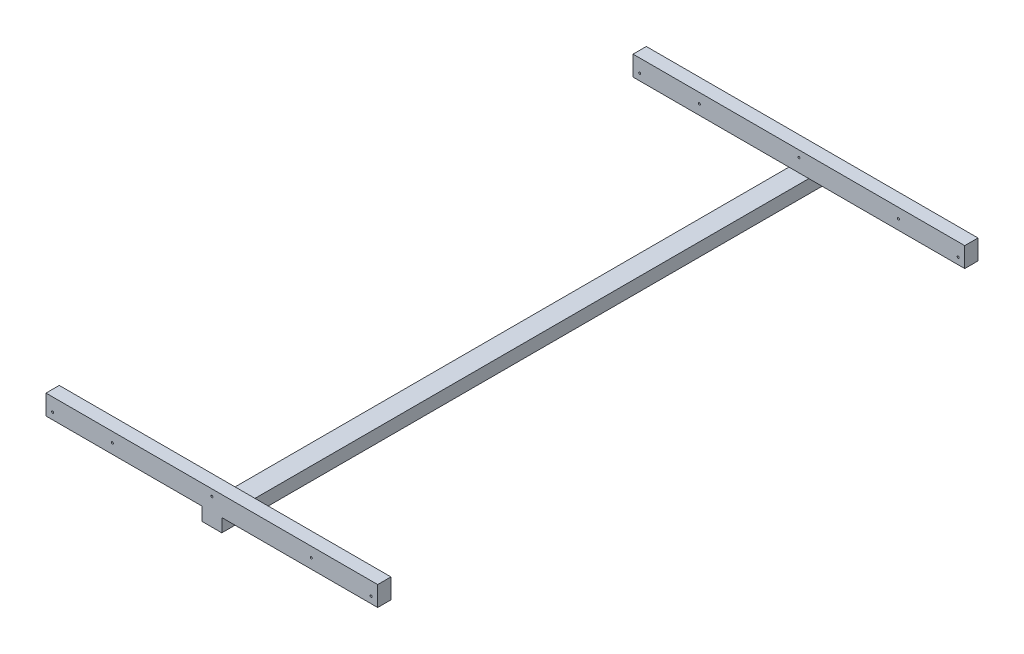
ISO-10303-21;
HEADER;
FILE_DESCRIPTION(('STEP AP214'),'2;1');
FILE_NAME('part.step','',(''),(''),'','','');
FILE_SCHEMA(('AUTOMOTIVE_DESIGN { 1 0 10303 214 1 1 1 1 }'));
ENDSEC;
DATA;
#1=APPLICATION_CONTEXT('core data for automotive mechanical design processes');
#2=APPLICATION_PROTOCOL_DEFINITION('international standard','automotive_design',2000,#1);
#3=PRODUCT_CONTEXT('',#1,'mechanical');
#4=PRODUCT('Part','Part','',(#3));
#5=PRODUCT_RELATED_PRODUCT_CATEGORY('part','',(#4));
#6=PRODUCT_DEFINITION_FORMATION('','',#4);
#7=PRODUCT_DEFINITION_CONTEXT('part definition',#1,'design');
#8=PRODUCT_DEFINITION('design','',#6,#7);
#9=PRODUCT_DEFINITION_SHAPE('','',#8);
#10=(LENGTH_UNIT() NAMED_UNIT(*) SI_UNIT(.MILLI.,.METRE.));
#11=(NAMED_UNIT(*) PLANE_ANGLE_UNIT() SI_UNIT($,.RADIAN.));
#12=(NAMED_UNIT(*) SI_UNIT($,.STERADIAN.) SOLID_ANGLE_UNIT());
#13=UNCERTAINTY_MEASURE_WITH_UNIT(LENGTH_MEASURE(1.E-05),#10,'distance_accuracy_value','');
#14=(GEOMETRIC_REPRESENTATION_CONTEXT(3) GLOBAL_UNCERTAINTY_ASSIGNED_CONTEXT((#13)) GLOBAL_UNIT_ASSIGNED_CONTEXT((#10,
#11,#12)) REPRESENTATION_CONTEXT('',''));
#15=CARTESIAN_POINT('',(0.,0.,0.));
#16=DIRECTION('',(0.,0.,1.));
#17=DIRECTION('',(1.,0.,0.));
#18=AXIS2_PLACEMENT_3D('',#15,#16,#17);
#19=CARTESIAN_POINT('',(30.,20.,905.));
#20=DIRECTION('',(0.,-1.,0.));
#21=DIRECTION('',(1.,0.,0.));
#22=AXIS2_PLACEMENT_3D('',#19,#20,#21);
#23=PLANE('',#22);
#24=DIRECTION('',(-1.,0.,0.));
#25=VECTOR('',#24,1.);
#26=CARTESIAN_POINT('',(500.,20.,-865.));
#27=LINE('',#26,#25);
#28=CARTESIAN_POINT('',(30.,20.,-865.));
#29=VERTEX_POINT('',#28);
#30=CARTESIAN_POINT('',(-30.,20.,-865.));
#31=VERTEX_POINT('',#30);
#32=EDGE_CURVE('E56',#29,#31,#27,.T.);
#33=ORIENTED_EDGE('',*,*,#32,.T.);
#34=DIRECTION('',(0.,0.,-1.));
#35=VECTOR('',#34,1.);
#36=CARTESIAN_POINT('',(-30.,20.,905.));
#37=LINE('',#36,#35);
#38=CARTESIAN_POINT('',(-30.,20.,865.));
#39=VERTEX_POINT('',#38);
#40=EDGE_CURVE('E323',#39,#31,#37,.T.);
#41=ORIENTED_EDGE('',*,*,#40,.F.);
#42=DIRECTION('',(-1.,0.,0.));
#43=VECTOR('',#42,1.);
#44=CARTESIAN_POINT('',(500.,20.,865.));
#45=LINE('',#44,#43);
#46=CARTESIAN_POINT('',(30.,20.,865.));
#47=VERTEX_POINT('',#46);
#48=EDGE_CURVE('E11',#47,#39,#45,.T.);
#49=ORIENTED_EDGE('',*,*,#48,.F.);
#50=DIRECTION('',(0.,0.,-1.));
#51=VECTOR('',#50,1.);
#52=CARTESIAN_POINT('',(30.,20.,905.));
#53=LINE('',#52,#51);
#54=EDGE_CURVE('E322',#47,#29,#53,.T.);
#55=ORIENTED_EDGE('',*,*,#54,.T.);
#56=EDGE_LOOP('',(#33,#41,#49,#55));
#57=FACE_BOUND('',#56,.T.);
#58=ADVANCED_FACE('F37',(#57),#23,.F.);
#59=CARTESIAN_POINT('',(-30.,-20.,905.));
#60=DIRECTION('',(1.,0.,0.));
#61=DIRECTION('',(0.,0.,-1.));
#62=AXIS2_PLACEMENT_3D('',#59,#60,#61);
#63=PLANE('',#62);
#64=DIRECTION('',(0.,-1.,0.));
#65=VECTOR('',#64,1.);
#66=CARTESIAN_POINT('',(-30.,-20.,-905.));
#67=LINE('',#66,#65);
#68=CARTESIAN_POINT('',(-30.,20.,-905.));
#69=VERTEX_POINT('',#68);
#70=CARTESIAN_POINT('',(-30.,-20.,-905.));
#71=VERTEX_POINT('',#70);
#72=EDGE_CURVE('E307',#69,#71,#67,.T.);
#73=ORIENTED_EDGE('',*,*,#72,.T.);
#74=DIRECTION('',(0.,0.,-1.));
#75=VECTOR('',#74,1.);
#76=CARTESIAN_POINT('',(-30.,-20.,905.));
#77=LINE('',#76,#75);
#78=CARTESIAN_POINT('',(-30.,-20.,905.));
#79=VERTEX_POINT('',#78);
#80=EDGE_CURVE('E46',#79,#71,#77,.T.);
#81=ORIENTED_EDGE('',*,*,#80,.F.);
#82=DIRECTION('',(0.,-1.,0.));
#83=VECTOR('',#82,1.);
#84=CARTESIAN_POINT('',(-30.,-20.,905.));
#85=LINE('',#84,#83);
#86=CARTESIAN_POINT('',(-30.,20.,905.));
#87=VERTEX_POINT('',#86);
#88=EDGE_CURVE('E313',#87,#79,#85,.T.);
#89=ORIENTED_EDGE('',*,*,#88,.F.);
#90=EDGE_CURVE('E320',#87,#39,#37,.T.);
#91=ORIENTED_EDGE('',*,*,#90,.T.);
#92=ORIENTED_EDGE('',*,*,#40,.T.);
#93=DIRECTION('',(0.,0.,1.));
#94=VECTOR('',#93,1.);
#95=CARTESIAN_POINT('',(-30.,20.0000000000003,905.));
#96=LINE('',#95,#94);
#97=EDGE_CURVE('E170',#69,#31,#96,.T.);
#98=ORIENTED_EDGE('',*,*,#97,.F.);
#99=EDGE_LOOP('',(#73,#81,#89,#91,#92,#98));
#100=FACE_BOUND('',#99,.T.);
#101=ADVANCED_FACE('F39',(#100),#63,.F.);
#102=CARTESIAN_POINT('',(30.,-20.,905.));
#103=DIRECTION('',(0.,1.,0.));
#104=DIRECTION('',(-1.,0.,0.));
#105=AXIS2_PLACEMENT_3D('',#102,#103,#104);
#106=PLANE('',#105);
#107=DIRECTION('',(1.,0.,0.));
#108=VECTOR('',#107,1.);
#109=CARTESIAN_POINT('',(30.,-20.,-905.));
#110=LINE('',#109,#108);
#111=CARTESIAN_POINT('',(30.,-20.,-905.));
#112=VERTEX_POINT('',#111);
#113=EDGE_CURVE('E300',#71,#112,#110,.T.);
#114=ORIENTED_EDGE('',*,*,#113,.T.);
#115=DIRECTION('',(0.,0.,-1.));
#116=VECTOR('',#115,1.);
#117=CARTESIAN_POINT('',(30.,-20.,905.));
#118=LINE('',#117,#116);
#119=CARTESIAN_POINT('',(30.,-20.,905.));
#120=VERTEX_POINT('',#119);
#121=EDGE_CURVE('E302',#120,#112,#118,.T.);
#122=ORIENTED_EDGE('',*,*,#121,.F.);
#123=DIRECTION('',(1.,0.,0.));
#124=VECTOR('',#123,1.);
#125=CARTESIAN_POINT('',(30.,-20.,905.));
#126=LINE('',#125,#124);
#127=EDGE_CURVE('E316',#79,#120,#126,.T.);
#128=ORIENTED_EDGE('',*,*,#127,.F.);
#129=ORIENTED_EDGE('',*,*,#80,.T.);
#130=EDGE_LOOP('',(#114,#122,#128,#129));
#131=FACE_BOUND('',#130,.T.);
#132=ADVANCED_FACE('F285',(#131),#106,.F.);
#133=CARTESIAN_POINT('',(30.,-20.,905.));
#134=DIRECTION('',(-1.,0.,0.));
#135=DIRECTION('',(0.,0.,1.));
#136=AXIS2_PLACEMENT_3D('',#133,#134,#135);
#137=PLANE('',#136);
#138=DIRECTION('',(0.,1.,0.));
#139=VECTOR('',#138,1.);
#140=CARTESIAN_POINT('',(30.,-20.,-905.));
#141=LINE('',#140,#139);
#142=CARTESIAN_POINT('',(30.,20.,-905.));
#143=VERTEX_POINT('',#142);
#144=EDGE_CURVE('E306',#112,#143,#141,.T.);
#145=ORIENTED_EDGE('',*,*,#144,.T.);
#146=DIRECTION('',(0.,0.,-1.));
#147=VECTOR('',#146,1.);
#148=CARTESIAN_POINT('',(30.,20.0000000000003,905.));
#149=LINE('',#148,#147);
#150=EDGE_CURVE('E64',#29,#143,#149,.T.);
#151=ORIENTED_EDGE('',*,*,#150,.F.);
#152=ORIENTED_EDGE('',*,*,#54,.F.);
#153=CARTESIAN_POINT('',(30.,20.,905.));
#154=VERTEX_POINT('',#153);
#155=EDGE_CURVE('E311',#154,#47,#53,.T.);
#156=ORIENTED_EDGE('',*,*,#155,.F.);
#157=DIRECTION('',(0.,1.,0.));
#158=VECTOR('',#157,1.);
#159=CARTESIAN_POINT('',(30.,-20.,905.));
#160=LINE('',#159,#158);
#161=EDGE_CURVE('E310',#120,#154,#160,.T.);
#162=ORIENTED_EDGE('',*,*,#161,.F.);
#163=ORIENTED_EDGE('',*,*,#121,.T.);
#164=EDGE_LOOP('',(#145,#151,#152,#156,#162,#163));
#165=FACE_BOUND('',#164,.T.);
#166=ADVANCED_FACE('F291',(#165),#137,.F.);
#167=CARTESIAN_POINT('',(0.,0.,905.));
#168=DIRECTION('',(0.,0.,1.));
#169=DIRECTION('',(1.,0.,0.));
#170=AXIS2_PLACEMENT_3D('',#167,#168,#169);
#171=PLANE('',#170);
#172=CARTESIAN_POINT('',(480.,40.,905.));
#173=DIRECTION('',(0.,0.,1.));
#174=DIRECTION('',(1.,0.,0.));
#175=AXIS2_PLACEMENT_3D('',#172,#173,#174);
#176=CIRCLE('',#175,2.99999999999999);
#177=CARTESIAN_POINT('',(483.,40.,905.));
#178=VERTEX_POINT('',#177);
#179=EDGE_CURVE('E205',#178,#178,#176,.T.);
#180=ORIENTED_EDGE('',*,*,#179,.F.);
#181=EDGE_LOOP('',(#180));
#182=FACE_BOUND('',#181,.T.);
#183=CARTESIAN_POINT('',(-480.,40.,905.));
#184=DIRECTION('',(0.,0.,1.));
#185=DIRECTION('',(1.,0.,0.));
#186=AXIS2_PLACEMENT_3D('',#183,#184,#185);
#187=CIRCLE('',#186,2.99999999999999);
#188=CARTESIAN_POINT('',(-477.,40.,905.));
#189=VERTEX_POINT('',#188);
#190=EDGE_CURVE('E211',#189,#189,#187,.T.);
#191=ORIENTED_EDGE('',*,*,#190,.F.);
#192=EDGE_LOOP('',(#191));
#193=FACE_BOUND('',#192,.T.);
#194=CARTESIAN_POINT('',(-300.,50.,905.));
#195=DIRECTION('',(0.,0.,1.));
#196=DIRECTION('',(1.,0.,0.));
#197=AXIS2_PLACEMENT_3D('',#194,#195,#196);
#198=CIRCLE('',#197,2.99999999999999);
#199=CARTESIAN_POINT('',(-297.,50.,905.));
#200=VERTEX_POINT('',#199);
#201=EDGE_CURVE('E218',#200,#200,#198,.T.);
#202=ORIENTED_EDGE('',*,*,#201,.F.);
#203=EDGE_LOOP('',(#202));
#204=FACE_BOUND('',#203,.T.);
#205=CARTESIAN_POINT('',(300.,50.,905.));
#206=DIRECTION('',(0.,0.,1.));
#207=DIRECTION('',(1.,0.,0.));
#208=AXIS2_PLACEMENT_3D('',#205,#206,#207);
#209=CIRCLE('',#208,2.99999999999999);
#210=CARTESIAN_POINT('',(303.,50.,905.));
#211=VERTEX_POINT('',#210);
#212=EDGE_CURVE('E225',#211,#211,#209,.T.);
#213=ORIENTED_EDGE('',*,*,#212,.F.);
#214=EDGE_LOOP('',(#213));
#215=FACE_BOUND('',#214,.T.);
#216=CARTESIAN_POINT('',(0.,60.,905.));
#217=DIRECTION('',(0.,0.,1.));
#218=DIRECTION('',(1.,0.,0.));
#219=AXIS2_PLACEMENT_3D('',#216,#217,#218);
#220=CIRCLE('',#219,3.);
#221=CARTESIAN_POINT('',(3.,60.,905.));
#222=VERTEX_POINT('',#221);
#223=EDGE_CURVE('E193',#222,#222,#220,.T.);
#224=ORIENTED_EDGE('',*,*,#223,.F.);
#225=EDGE_LOOP('',(#224));
#226=FACE_BOUND('',#225,.T.);
#227=ORIENTED_EDGE('',*,*,#88,.T.);
#228=ORIENTED_EDGE('',*,*,#127,.T.);
#229=ORIENTED_EDGE('',*,*,#161,.T.);
#230=DIRECTION('',(-1.,0.,0.));
#231=VECTOR('',#230,1.);
#232=CARTESIAN_POINT('',(500.,20.,905.));
#233=LINE('',#232,#231);
#234=CARTESIAN_POINT('',(500.,20.,905.));
#235=VERTEX_POINT('',#234);
#236=EDGE_CURVE('E330',#235,#154,#233,.T.);
#237=ORIENTED_EDGE('',*,*,#236,.F.);
#238=DIRECTION('',(0.,-1.,0.));
#239=VECTOR('',#238,1.);
#240=CARTESIAN_POINT('',(500.,80.,905.));
#241=LINE('',#240,#239);
#242=CARTESIAN_POINT('',(500.,80.,905.));
#243=VERTEX_POINT('',#242);
#244=EDGE_CURVE('E419',#243,#235,#241,.T.);
#245=ORIENTED_EDGE('',*,*,#244,.F.);
#246=DIRECTION('',(-1.,0.,0.));
#247=VECTOR('',#246,1.);
#248=CARTESIAN_POINT('',(500.,80.,905.));
#249=LINE('',#248,#247);
#250=CARTESIAN_POINT('',(-500.,80.,905.));
#251=VERTEX_POINT('',#250);
#252=EDGE_CURVE('E417',#243,#251,#249,.T.);
#253=ORIENTED_EDGE('',*,*,#252,.T.);
#254=DIRECTION('',(0.,-1.,0.));
#255=VECTOR('',#254,1.);
#256=CARTESIAN_POINT('',(-500.,80.,905.));
#257=LINE('',#256,#255);
#258=CARTESIAN_POINT('',(-500.,20.,905.));
#259=VERTEX_POINT('',#258);
#260=EDGE_CURVE('E346',#251,#259,#257,.T.);
#261=ORIENTED_EDGE('',*,*,#260,.T.);
#262=EDGE_CURVE('E336',#87,#259,#233,.T.);
#263=ORIENTED_EDGE('',*,*,#262,.F.);
#264=EDGE_LOOP('',(#227,#228,#229,#237,#245,#253,#261,#263));
#265=FACE_BOUND('',#264,.T.);
#266=ADVANCED_FACE('F293',(#182,#193,#204,#215,#226,#265),#171,.T.);
#267=CARTESIAN_POINT('',(0.,0.,-905.));
#268=DIRECTION('',(0.,0.,1.));
#269=DIRECTION('',(1.,0.,0.));
#270=AXIS2_PLACEMENT_3D('',#267,#268,#269);
#271=PLANE('',#270);
#272=CARTESIAN_POINT('',(480.,40.,-905.));
#273=DIRECTION('',(0.,0.,1.));
#274=DIRECTION('',(1.,0.,0.));
#275=AXIS2_PLACEMENT_3D('',#272,#273,#274);
#276=CIRCLE('',#275,2.99999999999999);
#277=CARTESIAN_POINT('',(483.,40.,-905.));
#278=VERTEX_POINT('',#277);
#279=EDGE_CURVE('E241',#278,#278,#276,.T.);
#280=ORIENTED_EDGE('',*,*,#279,.T.);
#281=EDGE_LOOP('',(#280));
#282=FACE_BOUND('',#281,.T.);
#283=CARTESIAN_POINT('',(-480.,40.,-905.));
#284=DIRECTION('',(0.,0.,1.));
#285=DIRECTION('',(-1.,0.,0.));
#286=AXIS2_PLACEMENT_3D('',#283,#284,#285);
#287=CIRCLE('',#286,2.99999999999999);
#288=CARTESIAN_POINT('',(-483.,40.,-905.));
#289=VERTEX_POINT('',#288);
#290=EDGE_CURVE('E238',#289,#289,#287,.T.);
#291=ORIENTED_EDGE('',*,*,#290,.T.);
#292=EDGE_LOOP('',(#291));
#293=FACE_BOUND('',#292,.T.);
#294=CARTESIAN_POINT('',(-300.,50.,-905.));
#295=DIRECTION('',(0.,0.,1.));
#296=DIRECTION('',(1.,0.,0.));
#297=AXIS2_PLACEMENT_3D('',#294,#295,#296);
#298=CIRCLE('',#297,2.99999999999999);
#299=CARTESIAN_POINT('',(-297.,50.,-905.));
#300=VERTEX_POINT('',#299);
#301=EDGE_CURVE('E235',#300,#300,#298,.T.);
#302=ORIENTED_EDGE('',*,*,#301,.T.);
#303=EDGE_LOOP('',(#302));
#304=FACE_BOUND('',#303,.T.);
#305=CARTESIAN_POINT('',(300.,50.,-905.));
#306=DIRECTION('',(0.,0.,1.));
#307=DIRECTION('',(-1.,0.,0.));
#308=AXIS2_PLACEMENT_3D('',#305,#306,#307);
#309=CIRCLE('',#308,2.99999999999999);
#310=CARTESIAN_POINT('',(297.,50.,-905.));
#311=VERTEX_POINT('',#310);
#312=EDGE_CURVE('E232',#311,#311,#309,.T.);
#313=ORIENTED_EDGE('',*,*,#312,.T.);
#314=EDGE_LOOP('',(#313));
#315=FACE_BOUND('',#314,.T.);
#316=CARTESIAN_POINT('',(0.,60.,-905.));
#317=DIRECTION('',(0.,0.,1.));
#318=DIRECTION('',(1.,0.,0.));
#319=AXIS2_PLACEMENT_3D('',#316,#317,#318);
#320=CIRCLE('',#319,3.);
#321=CARTESIAN_POINT('',(3.,60.,-905.));
#322=VERTEX_POINT('',#321);
#323=EDGE_CURVE('E202',#322,#322,#320,.T.);
#324=ORIENTED_EDGE('',*,*,#323,.T.);
#325=EDGE_LOOP('',(#324));
#326=FACE_BOUND('',#325,.T.);
#327=ORIENTED_EDGE('',*,*,#72,.F.);
#328=DIRECTION('',(-1.,0.,0.));
#329=VECTOR('',#328,1.);
#330=CARTESIAN_POINT('',(500.,20.,-905.));
#331=LINE('',#330,#329);
#332=CARTESIAN_POINT('',(-500.,20.,-905.));
#333=VERTEX_POINT('',#332);
#334=EDGE_CURVE('E177',#69,#333,#331,.T.);
#335=ORIENTED_EDGE('',*,*,#334,.T.);
#336=DIRECTION('',(0.,1.,0.));
#337=VECTOR('',#336,1.);
#338=CARTESIAN_POINT('',(-500.,80.,-905.));
#339=LINE('',#338,#337);
#340=CARTESIAN_POINT('',(-500.,80.,-905.));
#341=VERTEX_POINT('',#340);
#342=EDGE_CURVE('E187',#333,#341,#339,.T.);
#343=ORIENTED_EDGE('',*,*,#342,.T.);
#344=DIRECTION('',(-1.,0.,0.));
#345=VECTOR('',#344,1.);
#346=CARTESIAN_POINT('',(500.,80.,-905.));
#347=LINE('',#346,#345);
#348=CARTESIAN_POINT('',(500.,80.,-905.));
#349=VERTEX_POINT('',#348);
#350=EDGE_CURVE('E180',#349,#341,#347,.T.);
#351=ORIENTED_EDGE('',*,*,#350,.F.);
#352=DIRECTION('',(0.,1.,0.));
#353=VECTOR('',#352,1.);
#354=CARTESIAN_POINT('',(500.,80.,-905.));
#355=LINE('',#354,#353);
#356=CARTESIAN_POINT('',(500.,20.,-905.));
#357=VERTEX_POINT('',#356);
#358=EDGE_CURVE('E153',#357,#349,#355,.T.);
#359=ORIENTED_EDGE('',*,*,#358,.F.);
#360=EDGE_CURVE('E150',#357,#143,#331,.T.);
#361=ORIENTED_EDGE('',*,*,#360,.T.);
#362=ORIENTED_EDGE('',*,*,#144,.F.);
#363=ORIENTED_EDGE('',*,*,#113,.F.);
#364=EDGE_LOOP('',(#327,#335,#343,#351,#359,#361,#362,#363));
#365=FACE_BOUND('',#364,.T.);
#366=ADVANCED_FACE('F289',(#282,#293,#304,#315,#326,#365),#271,.F.);
#367=CARTESIAN_POINT('',(500.,20.,865.));
#368=DIRECTION('',(0.,1.,0.));
#369=DIRECTION('',(0.,0.,1.));
#370=AXIS2_PLACEMENT_3D('',#367,#368,#369);
#371=PLANE('',#370);
#372=ORIENTED_EDGE('',*,*,#236,.T.);
#373=ORIENTED_EDGE('',*,*,#155,.T.);
#374=CARTESIAN_POINT('',(500.,20.,865.));
#375=VERTEX_POINT('',#374);
#376=EDGE_CURVE('E48',#375,#47,#45,.T.);
#377=ORIENTED_EDGE('',*,*,#376,.F.);
#378=DIRECTION('',(0.,0.,-1.));
#379=VECTOR('',#378,1.);
#380=CARTESIAN_POINT('',(500.,20.,865.));
#381=LINE('',#380,#379);
#382=EDGE_CURVE('E332',#235,#375,#381,.T.);
#383=ORIENTED_EDGE('',*,*,#382,.F.);
#384=EDGE_LOOP('',(#372,#373,#377,#383));
#385=FACE_BOUND('',#384,.T.);
#386=ADVANCED_FACE('F331',(#385),#371,.F.);
#387=ORIENTED_EDGE('',*,*,#90,.F.);
#388=ORIENTED_EDGE('',*,*,#262,.T.);
#389=DIRECTION('',(0.,0.,-1.));
#390=VECTOR('',#389,1.);
#391=CARTESIAN_POINT('',(-500.,20.,865.));
#392=LINE('',#391,#390);
#393=CARTESIAN_POINT('',(-500.,20.,865.));
#394=VERTEX_POINT('',#393);
#395=EDGE_CURVE('E406',#259,#394,#392,.T.);
#396=ORIENTED_EDGE('',*,*,#395,.T.);
#397=EDGE_CURVE('E49',#39,#394,#45,.T.);
#398=ORIENTED_EDGE('',*,*,#397,.F.);
#399=EDGE_LOOP('',(#387,#388,#396,#398));
#400=FACE_BOUND('',#399,.T.);
#401=ADVANCED_FACE('F384',(#400),#371,.F.);
#402=CARTESIAN_POINT('',(500.,80.,865.));
#403=DIRECTION('',(0.,0.,1.));
#404=DIRECTION('',(1.,0.,0.));
#405=AXIS2_PLACEMENT_3D('',#402,#403,#404);
#406=PLANE('',#405);
#407=CARTESIAN_POINT('',(480.,40.,865.));
#408=DIRECTION('',(0.,0.,1.));
#409=DIRECTION('',(1.,0.,0.));
#410=AXIS2_PLACEMENT_3D('',#407,#408,#409);
#411=CIRCLE('',#410,2.99999999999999);
#412=CARTESIAN_POINT('',(483.,40.,865.));
#413=VERTEX_POINT('',#412);
#414=EDGE_CURVE('E208',#413,#413,#411,.T.);
#415=ORIENTED_EDGE('',*,*,#414,.T.);
#416=EDGE_LOOP('',(#415));
#417=FACE_BOUND('',#416,.T.);
#418=CARTESIAN_POINT('',(-480.,40.,865.));
#419=DIRECTION('',(0.,0.,1.));
#420=DIRECTION('',(1.,0.,0.));
#421=AXIS2_PLACEMENT_3D('',#418,#419,#420);
#422=CIRCLE('',#421,2.99999999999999);
#423=CARTESIAN_POINT('',(-477.,40.,865.));
#424=VERTEX_POINT('',#423);
#425=EDGE_CURVE('E214',#424,#424,#422,.T.);
#426=ORIENTED_EDGE('',*,*,#425,.T.);
#427=EDGE_LOOP('',(#426));
#428=FACE_BOUND('',#427,.T.);
#429=CARTESIAN_POINT('',(-300.,50.,865.));
#430=DIRECTION('',(0.,0.,1.));
#431=DIRECTION('',(1.,0.,0.));
#432=AXIS2_PLACEMENT_3D('',#429,#430,#431);
#433=CIRCLE('',#432,2.99999999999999);
#434=CARTESIAN_POINT('',(-297.,50.,865.));
#435=VERTEX_POINT('',#434);
#436=EDGE_CURVE('E221',#435,#435,#433,.T.);
#437=ORIENTED_EDGE('',*,*,#436,.T.);
#438=EDGE_LOOP('',(#437));
#439=FACE_BOUND('',#438,.T.);
#440=CARTESIAN_POINT('',(300.,50.,865.));
#441=DIRECTION('',(0.,0.,1.));
#442=DIRECTION('',(1.,0.,0.));
#443=AXIS2_PLACEMENT_3D('',#440,#441,#442);
#444=CIRCLE('',#443,2.99999999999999);
#445=CARTESIAN_POINT('',(303.,50.,865.));
#446=VERTEX_POINT('',#445);
#447=EDGE_CURVE('E228',#446,#446,#444,.T.);
#448=ORIENTED_EDGE('',*,*,#447,.T.);
#449=EDGE_LOOP('',(#448));
#450=FACE_BOUND('',#449,.T.);
#451=CARTESIAN_POINT('',(0.,60.,865.));
#452=DIRECTION('',(0.,0.,1.));
#453=DIRECTION('',(1.,0.,0.));
#454=AXIS2_PLACEMENT_3D('',#451,#452,#453);
#455=CIRCLE('',#454,3.);
#456=CARTESIAN_POINT('',(3.,60.,865.));
#457=VERTEX_POINT('',#456);
#458=EDGE_CURVE('E198',#457,#457,#455,.T.);
#459=ORIENTED_EDGE('',*,*,#458,.T.);
#460=EDGE_LOOP('',(#459));
#461=FACE_BOUND('',#460,.T.);
#462=DIRECTION('',(0.,1.,0.));
#463=VECTOR('',#462,1.);
#464=CARTESIAN_POINT('',(-500.,80.,865.));
#465=LINE('',#464,#463);
#466=CARTESIAN_POINT('',(-500.,80.,865.));
#467=VERTEX_POINT('',#466);
#468=EDGE_CURVE('E425',#394,#467,#465,.T.);
#469=ORIENTED_EDGE('',*,*,#468,.T.);
#470=DIRECTION('',(-1.,0.,0.));
#471=VECTOR('',#470,1.);
#472=CARTESIAN_POINT('',(500.,80.,865.));
#473=LINE('',#472,#471);
#474=CARTESIAN_POINT('',(500.,80.,865.));
#475=VERTEX_POINT('',#474);
#476=EDGE_CURVE('E409',#475,#467,#473,.T.);
#477=ORIENTED_EDGE('',*,*,#476,.F.);
#478=DIRECTION('',(0.,1.,0.));
#479=VECTOR('',#478,1.);
#480=CARTESIAN_POINT('',(500.,80.,865.));
#481=LINE('',#480,#479);
#482=EDGE_CURVE('E412',#375,#475,#481,.T.);
#483=ORIENTED_EDGE('',*,*,#482,.F.);
#484=ORIENTED_EDGE('',*,*,#376,.T.);
#485=ORIENTED_EDGE('',*,*,#48,.T.);
#486=ORIENTED_EDGE('',*,*,#397,.T.);
#487=EDGE_LOOP('',(#469,#477,#483,#484,#485,#486));
#488=FACE_BOUND('',#487,.T.);
#489=ADVANCED_FACE('F380',(#417,#428,#439,#450,#461,#488),#406,.F.);
#490=CARTESIAN_POINT('',(500.,80.,865.));
#491=DIRECTION('',(0.,-1.,0.));
#492=DIRECTION('',(0.,0.,-1.));
#493=AXIS2_PLACEMENT_3D('',#490,#491,#492);
#494=PLANE('',#493);
#495=DIRECTION('',(0.,0.,1.));
#496=VECTOR('',#495,1.);
#497=CARTESIAN_POINT('',(-500.,80.,865.));
#498=LINE('',#497,#496);
#499=EDGE_CURVE('E427',#467,#251,#498,.T.);
#500=ORIENTED_EDGE('',*,*,#499,.T.);
#501=ORIENTED_EDGE('',*,*,#252,.F.);
#502=DIRECTION('',(0.,0.,1.));
#503=VECTOR('',#502,1.);
#504=CARTESIAN_POINT('',(500.,80.,865.));
#505=LINE('',#504,#503);
#506=EDGE_CURVE('E415',#475,#243,#505,.T.);
#507=ORIENTED_EDGE('',*,*,#506,.F.);
#508=ORIENTED_EDGE('',*,*,#476,.T.);
#509=EDGE_LOOP('',(#500,#501,#507,#508));
#510=FACE_BOUND('',#509,.T.);
#511=ADVANCED_FACE('F373',(#510),#494,.F.);
#512=CARTESIAN_POINT('',(500.,0.,0.));
#513=DIRECTION('',(-1.,0.,0.));
#514=DIRECTION('',(0.,0.,1.));
#515=AXIS2_PLACEMENT_3D('',#512,#513,#514);
#516=PLANE('',#515);
#517=ORIENTED_EDGE('',*,*,#244,.T.);
#518=ORIENTED_EDGE('',*,*,#382,.T.);
#519=ORIENTED_EDGE('',*,*,#482,.T.);
#520=ORIENTED_EDGE('',*,*,#506,.T.);
#521=EDGE_LOOP('',(#517,#518,#519,#520));
#522=FACE_BOUND('',#521,.T.);
#523=ADVANCED_FACE('F370',(#522),#516,.F.);
#524=CARTESIAN_POINT('',(-500.,0.,0.));
#525=DIRECTION('',(-1.,0.,0.));
#526=DIRECTION('',(0.,0.,1.));
#527=AXIS2_PLACEMENT_3D('',#524,#525,#526);
#528=PLANE('',#527);
#529=ORIENTED_EDGE('',*,*,#260,.F.);
#530=ORIENTED_EDGE('',*,*,#499,.F.);
#531=ORIENTED_EDGE('',*,*,#468,.F.);
#532=ORIENTED_EDGE('',*,*,#395,.F.);
#533=EDGE_LOOP('',(#529,#530,#531,#532));
#534=FACE_BOUND('',#533,.T.);
#535=ADVANCED_FACE('F368',(#534),#528,.T.);
#536=CARTESIAN_POINT('',(500.,20.,-865.));
#537=DIRECTION('',(0.,1.,0.));
#538=DIRECTION('',(0.,0.,1.));
#539=AXIS2_PLACEMENT_3D('',#536,#537,#538);
#540=PLANE('',#539);
#541=ORIENTED_EDGE('',*,*,#334,.F.);
#542=ORIENTED_EDGE('',*,*,#97,.T.);
#543=CARTESIAN_POINT('',(-500.,20.,-865.));
#544=VERTEX_POINT('',#543);
#545=EDGE_CURVE('E169',#31,#544,#27,.T.);
#546=ORIENTED_EDGE('',*,*,#545,.T.);
#547=DIRECTION('',(0.,0.,-1.));
#548=VECTOR('',#547,1.);
#549=CARTESIAN_POINT('',(-500.,20.,-865.));
#550=LINE('',#549,#548);
#551=EDGE_CURVE('E189',#544,#333,#550,.T.);
#552=ORIENTED_EDGE('',*,*,#551,.T.);
#553=EDGE_LOOP('',(#541,#542,#546,#552));
#554=FACE_BOUND('',#553,.T.);
#555=ADVANCED_FACE('F345',(#554),#540,.F.);
#556=CARTESIAN_POINT('',(500.,20.,-865.));
#557=VERTEX_POINT('',#556);
#558=EDGE_CURVE('E148',#557,#29,#27,.T.);
#559=ORIENTED_EDGE('',*,*,#558,.T.);
#560=ORIENTED_EDGE('',*,*,#150,.T.);
#561=ORIENTED_EDGE('',*,*,#360,.F.);
#562=DIRECTION('',(0.,0.,-1.));
#563=VECTOR('',#562,1.);
#564=CARTESIAN_POINT('',(500.,20.,-865.));
#565=LINE('',#564,#563);
#566=EDGE_CURVE('E144',#557,#357,#565,.T.);
#567=ORIENTED_EDGE('',*,*,#566,.F.);
#568=EDGE_LOOP('',(#559,#560,#561,#567));
#569=FACE_BOUND('',#568,.T.);
#570=ADVANCED_FACE('F146',(#569),#540,.F.);
#571=CARTESIAN_POINT('',(500.,80.,-865.));
#572=DIRECTION('',(0.,0.,-1.));
#573=DIRECTION('',(-1.,0.,0.));
#574=AXIS2_PLACEMENT_3D('',#571,#572,#573);
#575=PLANE('',#574);
#576=CARTESIAN_POINT('',(480.,40.,-865.));
#577=DIRECTION('',(0.,0.,-1.));
#578=DIRECTION('',(-1.,0.,0.));
#579=AXIS2_PLACEMENT_3D('',#576,#577,#578);
#580=CIRCLE('',#579,2.99999999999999);
#581=CARTESIAN_POINT('',(477.,40.,-865.));
#582=VERTEX_POINT('',#581);
#583=EDGE_CURVE('E41',#582,#582,#580,.T.);
#584=ORIENTED_EDGE('',*,*,#583,.T.);
#585=EDGE_LOOP('',(#584));
#586=FACE_BOUND('',#585,.T.);
#587=CARTESIAN_POINT('',(-480.,40.,-865.));
#588=DIRECTION('',(0.,0.,-1.));
#589=DIRECTION('',(-1.,0.,0.));
#590=AXIS2_PLACEMENT_3D('',#587,#588,#589);
#591=CIRCLE('',#590,2.99999999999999);
#592=CARTESIAN_POINT('',(-483.,40.,-865.));
#593=VERTEX_POINT('',#592);
#594=EDGE_CURVE('E217',#593,#593,#591,.T.);
#595=ORIENTED_EDGE('',*,*,#594,.T.);
#596=EDGE_LOOP('',(#595));
#597=FACE_BOUND('',#596,.T.);
#598=CARTESIAN_POINT('',(-300.,50.,-865.));
#599=DIRECTION('',(0.,0.,-1.));
#600=DIRECTION('',(-1.,0.,0.));
#601=AXIS2_PLACEMENT_3D('',#598,#599,#600);
#602=CIRCLE('',#601,2.99999999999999);
#603=CARTESIAN_POINT('',(-303.,50.,-865.));
#604=VERTEX_POINT('',#603);
#605=EDGE_CURVE('E224',#604,#604,#602,.T.);
#606=ORIENTED_EDGE('',*,*,#605,.T.);
#607=EDGE_LOOP('',(#606));
#608=FACE_BOUND('',#607,.T.);
#609=CARTESIAN_POINT('',(300.,50.,-865.));
#610=DIRECTION('',(0.,0.,-1.));
#611=DIRECTION('',(-1.,0.,0.));
#612=AXIS2_PLACEMENT_3D('',#609,#610,#611);
#613=CIRCLE('',#612,2.99999999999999);
#614=CARTESIAN_POINT('',(297.,50.,-865.));
#615=VERTEX_POINT('',#614);
#616=EDGE_CURVE('E231',#615,#615,#613,.T.);
#617=ORIENTED_EDGE('',*,*,#616,.T.);
#618=EDGE_LOOP('',(#617));
#619=FACE_BOUND('',#618,.T.);
#620=CARTESIAN_POINT('',(0.,60.,-865.));
#621=DIRECTION('',(0.,0.,-1.));
#622=DIRECTION('',(-1.,0.,0.));
#623=AXIS2_PLACEMENT_3D('',#620,#621,#622);
#624=CIRCLE('',#623,3.);
#625=CARTESIAN_POINT('',(-3.,60.,-865.));
#626=VERTEX_POINT('',#625);
#627=EDGE_CURVE('E201',#626,#626,#624,.T.);
#628=ORIENTED_EDGE('',*,*,#627,.T.);
#629=EDGE_LOOP('',(#628));
#630=FACE_BOUND('',#629,.T.);
#631=DIRECTION('',(0.,-1.,0.));
#632=VECTOR('',#631,1.);
#633=CARTESIAN_POINT('',(-500.,80.,-865.));
#634=LINE('',#633,#632);
#635=CARTESIAN_POINT('',(-500.,80.,-865.));
#636=VERTEX_POINT('',#635);
#637=EDGE_CURVE('E191',#636,#544,#634,.T.);
#638=ORIENTED_EDGE('',*,*,#637,.T.);
#639=ORIENTED_EDGE('',*,*,#545,.F.);
#640=ORIENTED_EDGE('',*,*,#32,.F.);
#641=ORIENTED_EDGE('',*,*,#558,.F.);
#642=DIRECTION('',(0.,-1.,0.));
#643=VECTOR('',#642,1.);
#644=CARTESIAN_POINT('',(500.,80.,-865.));
#645=LINE('',#644,#643);
#646=CARTESIAN_POINT('',(500.,80.,-865.));
#647=VERTEX_POINT('',#646);
#648=EDGE_CURVE('E154',#647,#557,#645,.T.);
#649=ORIENTED_EDGE('',*,*,#648,.F.);
#650=DIRECTION('',(-1.,0.,0.));
#651=VECTOR('',#650,1.);
#652=CARTESIAN_POINT('',(500.,80.,-865.));
#653=LINE('',#652,#651);
#654=EDGE_CURVE('E184',#647,#636,#653,.T.);
#655=ORIENTED_EDGE('',*,*,#654,.T.);
#656=EDGE_LOOP('',(#638,#639,#640,#641,#649,#655));
#657=FACE_BOUND('',#656,.T.);
#658=ADVANCED_FACE('F166',(#586,#597,#608,#619,#630,#657),#575,.F.);
#659=CARTESIAN_POINT('',(500.,80.,-865.));
#660=DIRECTION('',(0.,-1.,0.));
#661=DIRECTION('',(0.,0.,-1.));
#662=AXIS2_PLACEMENT_3D('',#659,#660,#661);
#663=PLANE('',#662);
#664=DIRECTION('',(0.,0.,1.));
#665=VECTOR('',#664,1.);
#666=CARTESIAN_POINT('',(-500.,80.,-865.));
#667=LINE('',#666,#665);
#668=EDGE_CURVE('E163',#341,#636,#667,.T.);
#669=ORIENTED_EDGE('',*,*,#668,.T.);
#670=ORIENTED_EDGE('',*,*,#654,.F.);
#671=DIRECTION('',(0.,0.,1.));
#672=VECTOR('',#671,1.);
#673=CARTESIAN_POINT('',(500.,80.,-865.));
#674=LINE('',#673,#672);
#675=EDGE_CURVE('E159',#349,#647,#674,.T.);
#676=ORIENTED_EDGE('',*,*,#675,.F.);
#677=ORIENTED_EDGE('',*,*,#350,.T.);
#678=EDGE_LOOP('',(#669,#670,#676,#677));
#679=FACE_BOUND('',#678,.T.);
#680=ADVANCED_FACE('F355',(#679),#663,.F.);
#681=CARTESIAN_POINT('',(500.,0.,0.));
#682=DIRECTION('',(1.,0.,0.));
#683=DIRECTION('',(0.,0.,-1.));
#684=AXIS2_PLACEMENT_3D('',#681,#682,#683);
#685=PLANE('',#684);
#686=ORIENTED_EDGE('',*,*,#648,.T.);
#687=ORIENTED_EDGE('',*,*,#566,.T.);
#688=ORIENTED_EDGE('',*,*,#358,.T.);
#689=ORIENTED_EDGE('',*,*,#675,.T.);
#690=EDGE_LOOP('',(#686,#687,#688,#689));
#691=FACE_BOUND('',#690,.T.);
#692=ADVANCED_FACE('F157',(#691),#685,.T.);
#693=CARTESIAN_POINT('',(-500.,0.,0.));
#694=DIRECTION('',(1.,0.,0.));
#695=DIRECTION('',(0.,0.,-1.));
#696=AXIS2_PLACEMENT_3D('',#693,#694,#695);
#697=PLANE('',#696);
#698=ORIENTED_EDGE('',*,*,#637,.F.);
#699=ORIENTED_EDGE('',*,*,#668,.F.);
#700=ORIENTED_EDGE('',*,*,#342,.F.);
#701=ORIENTED_EDGE('',*,*,#551,.F.);
#702=EDGE_LOOP('',(#698,#699,#700,#701));
#703=FACE_BOUND('',#702,.T.);
#704=ADVANCED_FACE('F351',(#703),#697,.F.);
#705=CARTESIAN_POINT('',(0.,60.,-905.));
#706=DIRECTION('',(0.,0.,1.));
#707=DIRECTION('',(1.,0.,0.));
#708=AXIS2_PLACEMENT_3D('',#705,#706,#707);
#709=CYLINDRICAL_SURFACE('',#708,3.);
#710=ORIENTED_EDGE('',*,*,#323,.F.);
#711=EDGE_LOOP('',(#710));
#712=FACE_BOUND('',#711,.T.);
#713=ORIENTED_EDGE('',*,*,#627,.F.);
#714=EDGE_LOOP('',(#713));
#715=FACE_BOUND('',#714,.T.);
#716=ADVANCED_FACE('F437',(#712,#715),#709,.F.);
#717=ORIENTED_EDGE('',*,*,#223,.T.);
#718=EDGE_LOOP('',(#717));
#719=FACE_BOUND('',#718,.T.);
#720=ORIENTED_EDGE('',*,*,#458,.F.);
#721=EDGE_LOOP('',(#720));
#722=FACE_BOUND('',#721,.T.);
#723=ADVANCED_FACE('F434',(#719,#722),#709,.F.);
#724=CARTESIAN_POINT('',(300.,50.,-905.));
#725=DIRECTION('',(0.,0.,1.));
#726=DIRECTION('',(1.,0.,0.));
#727=AXIS2_PLACEMENT_3D('',#724,#725,#726);
#728=CYLINDRICAL_SURFACE('',#727,2.99999999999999);
#729=ORIENTED_EDGE('',*,*,#312,.F.);
#730=EDGE_LOOP('',(#729));
#731=FACE_BOUND('',#730,.T.);
#732=ORIENTED_EDGE('',*,*,#616,.F.);
#733=EDGE_LOOP('',(#732));
#734=FACE_BOUND('',#733,.T.);
#735=ADVANCED_FACE('F273',(#731,#734),#728,.F.);
#736=CARTESIAN_POINT('',(-300.,50.,-905.));
#737=DIRECTION('',(0.,0.,1.));
#738=DIRECTION('',(1.,0.,0.));
#739=AXIS2_PLACEMENT_3D('',#736,#737,#738);
#740=CYLINDRICAL_SURFACE('',#739,2.99999999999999);
#741=ORIENTED_EDGE('',*,*,#301,.F.);
#742=EDGE_LOOP('',(#741));
#743=FACE_BOUND('',#742,.T.);
#744=ORIENTED_EDGE('',*,*,#605,.F.);
#745=EDGE_LOOP('',(#744));
#746=FACE_BOUND('',#745,.T.);
#747=ADVANCED_FACE('F261',(#743,#746),#740,.F.);
#748=CARTESIAN_POINT('',(-480.,40.,-905.));
#749=DIRECTION('',(0.,0.,1.));
#750=DIRECTION('',(1.,0.,0.));
#751=AXIS2_PLACEMENT_3D('',#748,#749,#750);
#752=CYLINDRICAL_SURFACE('',#751,2.99999999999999);
#753=ORIENTED_EDGE('',*,*,#290,.F.);
#754=EDGE_LOOP('',(#753));
#755=FACE_BOUND('',#754,.T.);
#756=ORIENTED_EDGE('',*,*,#594,.F.);
#757=EDGE_LOOP('',(#756));
#758=FACE_BOUND('',#757,.T.);
#759=ADVANCED_FACE('F258',(#755,#758),#752,.F.);
#760=CARTESIAN_POINT('',(480.,40.,-905.));
#761=DIRECTION('',(0.,0.,1.));
#762=DIRECTION('',(1.,0.,0.));
#763=AXIS2_PLACEMENT_3D('',#760,#761,#762);
#764=CYLINDRICAL_SURFACE('',#763,2.99999999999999);
#765=ORIENTED_EDGE('',*,*,#279,.F.);
#766=EDGE_LOOP('',(#765));
#767=FACE_BOUND('',#766,.T.);
#768=ORIENTED_EDGE('',*,*,#583,.F.);
#769=EDGE_LOOP('',(#768));
#770=FACE_BOUND('',#769,.T.);
#771=ADVANCED_FACE('F260',(#767,#770),#764,.F.);
#772=ORIENTED_EDGE('',*,*,#212,.T.);
#773=EDGE_LOOP('',(#772));
#774=FACE_BOUND('',#773,.T.);
#775=ORIENTED_EDGE('',*,*,#447,.F.);
#776=EDGE_LOOP('',(#775));
#777=FACE_BOUND('',#776,.T.);
#778=ADVANCED_FACE('F269',(#774,#777),#728,.F.);
#779=ORIENTED_EDGE('',*,*,#201,.T.);
#780=EDGE_LOOP('',(#779));
#781=FACE_BOUND('',#780,.T.);
#782=ORIENTED_EDGE('',*,*,#436,.F.);
#783=EDGE_LOOP('',(#782));
#784=FACE_BOUND('',#783,.T.);
#785=ADVANCED_FACE('F276',(#781,#784),#740,.F.);
#786=ORIENTED_EDGE('',*,*,#190,.T.);
#787=EDGE_LOOP('',(#786));
#788=FACE_BOUND('',#787,.T.);
#789=ORIENTED_EDGE('',*,*,#425,.F.);
#790=EDGE_LOOP('',(#789));
#791=FACE_BOUND('',#790,.T.);
#792=ADVANCED_FACE('F264',(#788,#791),#752,.F.);
#793=ORIENTED_EDGE('',*,*,#179,.T.);
#794=EDGE_LOOP('',(#793));
#795=FACE_BOUND('',#794,.T.);
#796=ORIENTED_EDGE('',*,*,#414,.F.);
#797=EDGE_LOOP('',(#796));
#798=FACE_BOUND('',#797,.T.);
#799=ADVANCED_FACE('F272',(#795,#798),#764,.F.);
#800=CLOSED_SHELL('',(#58,#101,#132,#166,#266,#366,#386,#401,#489,#511,#523,#535,#555,#570,#658,
#680,#692,#704,#716,#723,#735,#747,#759,#771,#778,#785,#792,#799));
#801=MANIFOLD_SOLID_BREP('B2',#800);
#802=ADVANCED_BREP_SHAPE_REPRESENTATION('',(#18,#801),#14);
#803=SHAPE_DEFINITION_REPRESENTATION(#9,#802);
ENDSEC;
END-ISO-10303-21;
